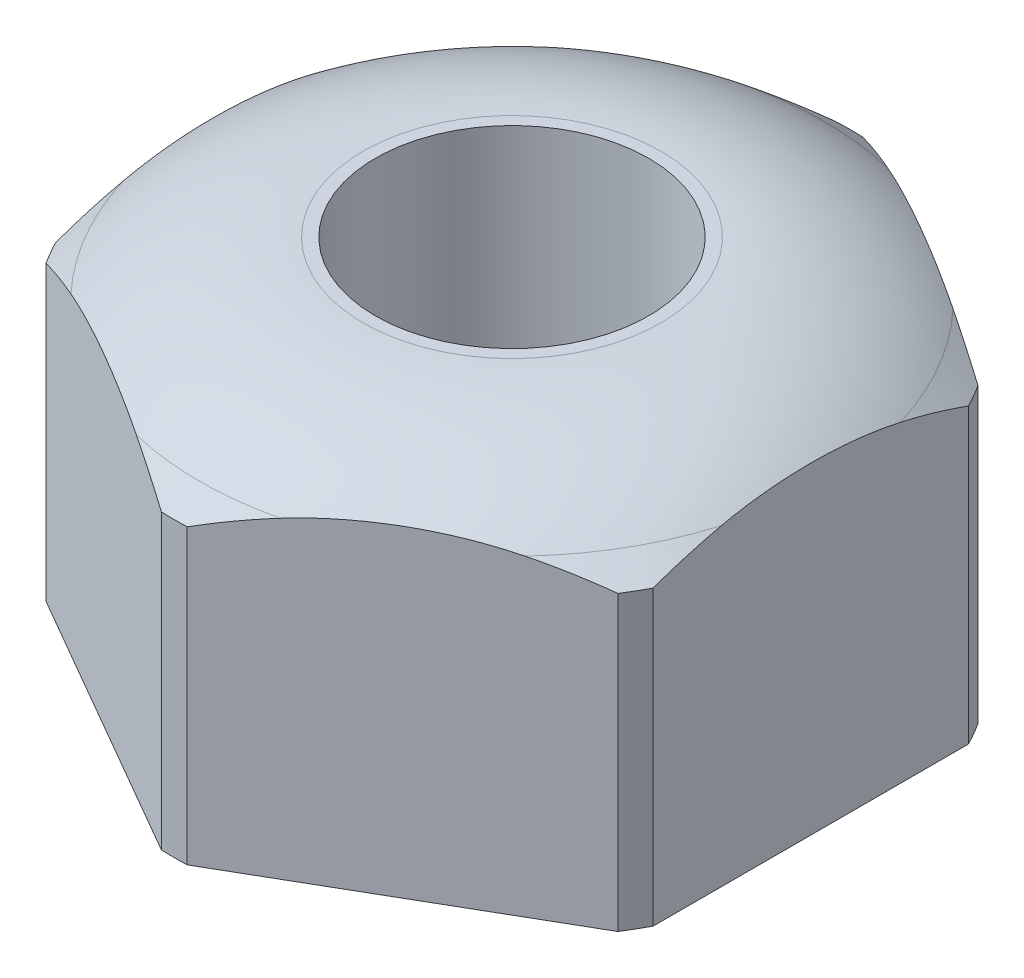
from build123d import *

# Parameters (mm, degrees)
SKETCH2_W          = 40.483291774
SKETCH2_H          = 39.090746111
CUT_EXTRUDE1_DEPTH = 31.699192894


with BuildPart() as part:
    # Sketch1 → Base-Revolve (revolve)
    with BuildSketch(Plane.XY, mode=Mode.PRIVATE) as base_revolve_sk:
        with BuildLine():
            Line((1.4224, 0), (1.4224, 3.8354))
            Line((1.4224, 3.8354), (1.5494, 3.8354))
            ThreePointArc((1.5494, 3.8354), (2.446881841, 3.6863051), (3.247950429, 3.255037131))
            Line((3.247950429, 3.255037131), (3.5179, 3.048))
            Line((3.5179, 3.048), (3.5179, 0))
            Line((3.5179, 0), (1.4224, 0))
        make_face()
    revolve(base_revolve_sk.sketch.rotate(Axis((0, -25.4, 0), (0, 1, 0)), 90), axis=Axis((0, -25.4, 0), (0, 1, 0)))

    # Sketch2 → Cut-Extrude1 (cut)
    with BuildSketch(Plane(origin=(0, 0, 0), x_dir=(1, 0, 0), z_dir=(0, 1, 0))):
        with Locations((0.511079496, 0.007923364)):
            Rectangle(SKETCH2_W, SKETCH2_H)
        Polygon((3.1115, 1.796425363), (0, 3.592850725), (-3.1115, 1.796425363), (-3.1115, -1.796425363), (0, -3.592850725), (3.1115, -1.796425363), align=None, mode=Mode.SUBTRACT)
    extrude(amount=CUT_EXTRUDE1_DEPTH, mode=Mode.SUBTRACT)


solid = part.part
